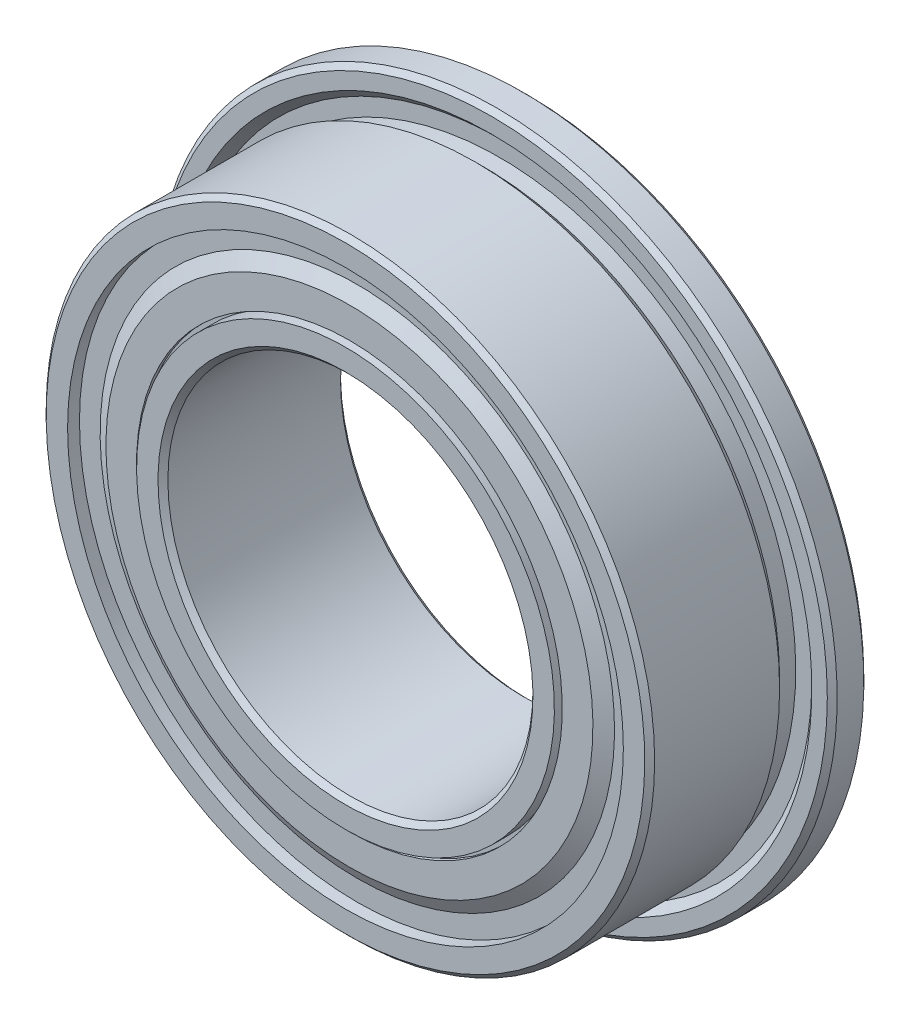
from build123d import *

# Parameters (mm, degrees)
FILLET1_SIZE      = 0.08125
FILLET2_SIZE      = 0.08125
CIRPATTERN3_COUNT = 17
SKETCH8_W         = 0.26
SKETCH8_H         = 0.216666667


with BuildPart() as part:
    # Sketch2 → Revolve1 (revolve)
    with BuildSketch(Plane(origin=(0, 0, 0), x_dir=(0, 0, -1), z_dir=(1, 0, 0)), mode=Mode.PRIVATE) as revolve1_sk:
        with BuildLine():
            Line((1.5, 5.6), (0.9, 5.6))
            Line((0.9, 5.6), (0.9, 5.265165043))
            Line((0.9, 5.265165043), (1.032582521, 5.132582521))
            Line((1.032582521, 5.132582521), (1.032582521, 4.867417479))
            Line((1.032582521, 4.867417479), (0.767417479, 4.867417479))
            Line((0.767417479, 4.867417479), (0.634834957, 5))
            Line((0.634834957, 5), (-1.5, 5))
            Line((-1.5, 5), (-1.5, 4.35))
            Line((-1.5, 4.35), (-0.487339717, 4.35))
            ThreePointArc((-0.487339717, 4.35), (0, 4.6), (0.487339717, 4.35))
            Line((0.487339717, 4.35), (1.5, 4.35))
            Line((1.5, 4.35), (1.5, 5.6))
        make_face()
        with BuildLine():
            Line((1.5, 3), (-1.5, 3))
            Line((-1.5, 3), (-1.5, 3.65))
            Line((-1.5, 3.65), (-0.487339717, 3.65))
            ThreePointArc((-0.487339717, 3.65), (0, 3.4), (0.487339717, 3.65))
            Line((0.487339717, 3.65), (1.5, 3.65))
            Line((1.5, 3.65), (1.5, 3))
        make_face()
    revolve(revolve1_sk.sketch.rotate(Axis((0, 0, 0), (0, 0, -1)), 180), axis=Axis((0, 0, 0), (0, 0, -1)))

    # Fillet1
    fillet1_edges = [part.edges().sort_by_distance(p)[0] for p in [
        (0, 5, 1.5),
        (0, 5.6, -1.5),
        (0, 5.6, -0.9),
    ]]
    chamfer(fillet1_edges, length=FILLET1_SIZE)

    # Fillet2
    fillet2_edges = [part.edges().sort_by_distance(p)[0] for p in [
        (0, 3, -1.5),
        (0, 3, 1.5),
    ]]
    chamfer(fillet2_edges, length=FILLET2_SIZE)

    # Sketch8 → Cut-Revolve1 (revolve, cut)
    with BuildSketch(Plane(origin=(0, 0, 0), x_dir=(0, 0, -1), z_dir=(1, 0, 0)), mode=Mode.PRIVATE) as cut_revolve1_sk:
        with Locations((-1.37, 4.458333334)):
            Rectangle(SKETCH8_W, SKETCH8_H)
        with Locations((1.37, 4.458333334)):
            Rectangle(SKETCH8_W, SKETCH8_H)
        with Locations((1.37, 3.541666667)):
            Rectangle(SKETCH8_W, SKETCH8_H)
        with Locations((-1.37, 3.541666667)):
            Rectangle(SKETCH8_W, SKETCH8_H)
    revolve(cut_revolve1_sk.sketch.rotate(Axis((0, 0, 0), (0, 0, -1)), 180), axis=Axis((0, 0, 0), (0, 0, -1)), mode=Mode.SUBTRACT)


with BuildPart() as body_2:
    # Sketch7 → Revolve3 (revolve)
    with BuildSketch(Plane.XY):
        with BuildLine():
            Line((0, 4.6), (0, 3.4))
            ThreePointArc((0, 3.4), (-0.6, 4), (0, 4.6))
        make_face()
    revolve(axis=Axis((0, 4.6, 0), (0, -1, 0)))


with BuildPart() as cirpattern3_1:
    # CirPattern3: pattern copy
    add(body_2.part.rotate(Axis((0, 0, 0), (0, 0, 1)), 1 * 360 / CIRPATTERN3_COUNT))


with BuildPart() as cirpattern3_2:
    # CirPattern3: pattern copy
    add(body_2.part.rotate(Axis((0, 0, 0), (0, 0, 1)), 2 * 360 / CIRPATTERN3_COUNT))


with BuildPart() as cirpattern3_3:
    # CirPattern3: pattern copy
    add(body_2.part.rotate(Axis((0, 0, 0), (0, 0, 1)), 3 * 360 / CIRPATTERN3_COUNT))


with BuildPart() as cirpattern3_4:
    # CirPattern3: pattern copy
    add(body_2.part.rotate(Axis((0, 0, 0), (0, 0, 1)), 4 * 360 / CIRPATTERN3_COUNT))


with BuildPart() as cirpattern3_5:
    # CirPattern3: pattern copy
    add(body_2.part.rotate(Axis((0, 0, 0), (0, 0, 1)), 5 * 360 / CIRPATTERN3_COUNT))


with BuildPart() as cirpattern3_6:
    # CirPattern3: pattern copy
    add(body_2.part.rotate(Axis((0, 0, 0), (0, 0, 1)), 6 * 360 / CIRPATTERN3_COUNT))


with BuildPart() as cirpattern3_7:
    # CirPattern3: pattern copy
    add(body_2.part.rotate(Axis((0, 0, 0), (0, 0, 1)), 7 * 360 / CIRPATTERN3_COUNT))


with BuildPart() as cirpattern3_8:
    # CirPattern3: pattern copy
    add(body_2.part.rotate(Axis((0, 0, 0), (0, 0, 1)), 8 * 360 / CIRPATTERN3_COUNT))


with BuildPart() as cirpattern3_9:
    # CirPattern3: pattern copy
    add(body_2.part.rotate(Axis((0, 0, 0), (0, 0, 1)), 9 * 360 / CIRPATTERN3_COUNT))


with BuildPart() as cirpattern3_10:
    # CirPattern3: pattern copy
    add(body_2.part.rotate(Axis((0, 0, 0), (0, 0, 1)), 10 * 360 / CIRPATTERN3_COUNT))


with BuildPart() as cirpattern3_11:
    # CirPattern3: pattern copy
    add(body_2.part.rotate(Axis((0, 0, 0), (0, 0, 1)), 11 * 360 / CIRPATTERN3_COUNT))


with BuildPart() as cirpattern3_12:
    # CirPattern3: pattern copy
    add(body_2.part.rotate(Axis((0, 0, 0), (0, 0, 1)), 12 * 360 / CIRPATTERN3_COUNT))


with BuildPart() as cirpattern3_13:
    # CirPattern3: pattern copy
    add(body_2.part.rotate(Axis((0, 0, 0), (0, 0, 1)), 13 * 360 / CIRPATTERN3_COUNT))


with BuildPart() as cirpattern3_14:
    # CirPattern3: pattern copy
    add(body_2.part.rotate(Axis((0, 0, 0), (0, 0, 1)), 14 * 360 / CIRPATTERN3_COUNT))


with BuildPart() as cirpattern3_15:
    # CirPattern3: pattern copy
    add(body_2.part.rotate(Axis((0, 0, 0), (0, 0, 1)), 15 * 360 / CIRPATTERN3_COUNT))


with BuildPart() as cirpattern3_16:
    # CirPattern3: pattern copy
    add(body_2.part.rotate(Axis((0, 0, 0), (0, 0, 1)), 16 * 360 / CIRPATTERN3_COUNT))


with BuildPart() as body_19:
    # Sketch9 → Revolve4 (revolve)
    with BuildSketch(Plane(origin=(0, 0, 0), x_dir=(0, 0, -1), z_dir=(1, 0, 0)), mode=Mode.PRIVATE) as revolve4_sk:
        Polygon((-1.24, 4.566666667), (-1.24, 4.20952381), (-1.37, 3.984357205), (-1.37, 3.498333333), (-1.435, 3.498333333), (-1.435, 4.001773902), (-1.305, 4.226940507), (-1.305, 4.566666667), align=None)
        Polygon((1.24, 4.566666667), (1.24, 4.20952381), (1.37, 3.984357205), (1.37, 3.498333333), (1.435, 3.498333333), (1.435, 4.001773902), (1.305, 4.226940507), (1.305, 4.566666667), align=None)
    revolve(revolve4_sk.sketch.rotate(Axis((0, 0, 0), (0, 0, -1)), 180), axis=Axis((0, 0, 0), (0, 0, -1)))


solid = Compound([part.part, body_2.part, cirpattern3_1.part, cirpattern3_2.part, cirpattern3_3.part, cirpattern3_4.part, cirpattern3_5.part, cirpattern3_6.part, cirpattern3_7.part, cirpattern3_8.part, cirpattern3_9.part, cirpattern3_10.part, cirpattern3_11.part, cirpattern3_12.part, cirpattern3_13.part, cirpattern3_14.part, cirpattern3_15.part, cirpattern3_16.part, body_19.part])
